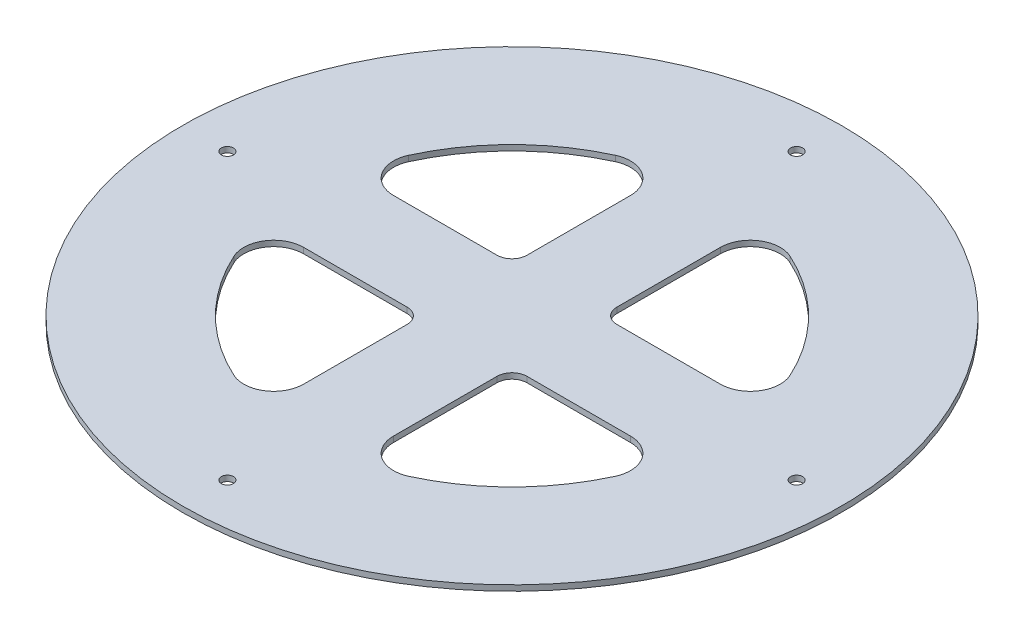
from build123d import *

# Parameters (mm, degrees)
SKETCH1_R          = 558.8
EXTRUDE1_DEPTH     = 9.525
SKETCH3_R          = 10.3124
CUT_EXTRUDE1_DEPTH = 791.319938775
CIRPATTERN1_COUNT  = 4


with BuildPart() as part:
    # Sketch1 → Extrude1 (new body)
    with BuildSketch(Plane(origin=(0, 0, 0), x_dir=(1, 0, 0), z_dir=(0, 1, 0))):
        with Locations(Location((0, 0, 0), (0, 0, 270))):
            Circle(SKETCH1_R)
        with BuildLine():
            Line((-76.2, 277.081287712), (-76.2, 101.6))
            ThreePointArc((-76.2, 101.6), (-83.639487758, 83.639487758), (-101.6, 76.2))
            Line((-101.6, 76.2), (-277.081287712, 76.2))
            ThreePointArc((-277.081287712, 76.2), (-319.835858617, 99.564864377), (-323.26150233, 148.166666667))
            ThreePointArc((-323.26150233, 148.166666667), (-251.44717139, 251.44717139), (-148.166666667, 323.26150233))
            ThreePointArc((-148.166666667, 323.26150233), (-99.564864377, 319.835858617), (-76.2, 277.081287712))
        make_face(mode=Mode.SUBTRACT)
        with BuildLine():
            Line((76.2, 277.081287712), (76.2, 101.6))
            ThreePointArc((76.2, 101.6), (83.639487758, 83.639487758), (101.6, 76.2))
            Line((101.6, 76.2), (277.081287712, 76.2))
            ThreePointArc((277.081287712, 76.2), (319.835858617, 99.564864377), (323.26150233, 148.166666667))
            ThreePointArc((323.26150233, 148.166666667), (251.44717139, 251.44717139), (148.166666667, 323.26150233))
            ThreePointArc((148.166666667, 323.26150233), (99.564864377, 319.835858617), (76.2, 277.081287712))
        make_face(mode=Mode.SUBTRACT)
        with BuildLine():
            Line((-277.081287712, -76.2), (-101.6, -76.2))
            ThreePointArc((-101.6, -76.2), (-83.639487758, -83.639487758), (-76.2, -101.6))
            Line((-76.2, -101.6), (-76.2, -277.081287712))
            ThreePointArc((-76.2, -277.081287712), (-99.564864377, -319.835858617), (-148.166666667, -323.26150233))
            ThreePointArc((-148.166666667, -323.26150233), (-251.44717139, -251.44717139), (-323.26150233, -148.166666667))
            ThreePointArc((-323.26150233, -148.166666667), (-319.835858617, -99.564864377), (-277.081287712, -76.2))
        make_face(mode=Mode.SUBTRACT)
        with BuildLine():
            Line((76.2, -101.6), (76.2, -277.081287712))
            ThreePointArc((76.2, -277.081287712), (99.564864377, -319.835858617), (148.166666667, -323.26150233))
            ThreePointArc((148.166666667, -323.26150233), (251.44717139, -251.44717139), (323.26150233, -148.166666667))
            ThreePointArc((323.26150233, -148.166666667), (319.835858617, -99.564864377), (277.081287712, -76.2))
            Line((277.081287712, -76.2), (101.6, -76.2))
            ThreePointArc((101.6, -76.2), (83.639487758, -83.639487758), (76.2, -101.6))
        make_face(mode=Mode.SUBTRACT)
    extrude(amount=-EXTRUDE1_DEPTH)

    # Sketch3 → Cut-Extrude1 (cut, through all)
    with BuildSketch(Plane(origin=(0, 0, 0), x_dir=(-1, 0, 0), z_dir=(0, 1, 0))):
        with Locations(Location((0, -482.6, 0), (0, 0, 90))):
            Circle(SKETCH3_R)
    cut_extrude1 = extrude(amount=-CUT_EXTRUDE1_DEPTH, mode=Mode.SUBTRACT)

    # CirPattern1: Cut-Extrude1 ×4 about axis
    cirpattern1_axis = Axis((0, 0, 0), (0, 1, 0))
    for i in range(1, CIRPATTERN1_COUNT):
        add(cut_extrude1.rotate(cirpattern1_axis, i * 360 / CIRPATTERN1_COUNT), mode=Mode.SUBTRACT)


solid = part.part
